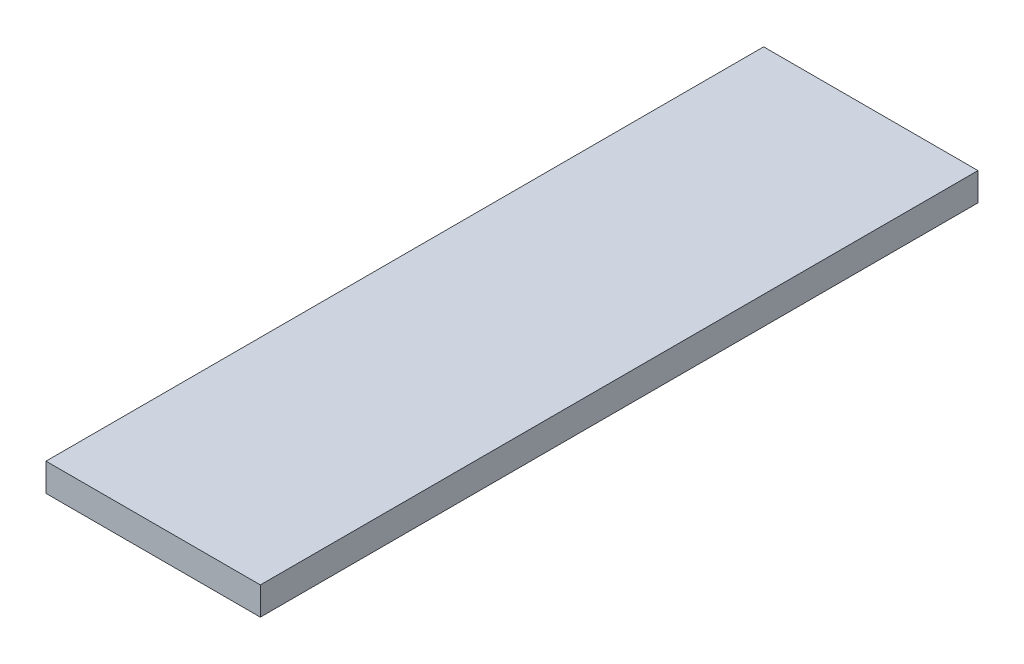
ISO-10303-21;
HEADER;
FILE_DESCRIPTION(('STEP AP214'),'2;1');
FILE_NAME('part.step','',(''),(''),'','','');
FILE_SCHEMA(('AUTOMOTIVE_DESIGN { 1 0 10303 214 1 1 1 1 }'));
ENDSEC;
DATA;
#1=APPLICATION_CONTEXT('core data for automotive mechanical design processes');
#2=APPLICATION_PROTOCOL_DEFINITION('international standard','automotive_design',2000,#1);
#3=PRODUCT_CONTEXT('',#1,'mechanical');
#4=PRODUCT('Part','Part','',(#3));
#5=PRODUCT_RELATED_PRODUCT_CATEGORY('part','',(#4));
#6=PRODUCT_DEFINITION_FORMATION('','',#4);
#7=PRODUCT_DEFINITION_CONTEXT('part definition',#1,'design');
#8=PRODUCT_DEFINITION('design','',#6,#7);
#9=PRODUCT_DEFINITION_SHAPE('','',#8);
#10=(LENGTH_UNIT() NAMED_UNIT(*) SI_UNIT(.MILLI.,.METRE.));
#11=(NAMED_UNIT(*) PLANE_ANGLE_UNIT() SI_UNIT($,.RADIAN.));
#12=(NAMED_UNIT(*) SI_UNIT($,.STERADIAN.) SOLID_ANGLE_UNIT());
#13=UNCERTAINTY_MEASURE_WITH_UNIT(LENGTH_MEASURE(1.E-05),#10,'distance_accuracy_value','');
#14=(GEOMETRIC_REPRESENTATION_CONTEXT(3) GLOBAL_UNCERTAINTY_ASSIGNED_CONTEXT((#13)) GLOBAL_UNIT_ASSIGNED_CONTEXT((#10,
#11,#12)) REPRESENTATION_CONTEXT('',''));
#15=CARTESIAN_POINT('',(0.,0.,0.));
#16=DIRECTION('',(0.,0.,1.));
#17=DIRECTION('',(1.,0.,0.));
#18=AXIS2_PLACEMENT_3D('',#15,#16,#17);
#19=CARTESIAN_POINT('',(-292.1,38.1,0.));
#20=DIRECTION('',(0.,0.,1.));
#21=DIRECTION('',(1.,0.,0.));
#22=AXIS2_PLACEMENT_3D('',#19,#20,#21);
#23=PLANE('',#22);
#24=DIRECTION('',(-1.,0.,0.));
#25=VECTOR('',#24,1.);
#26=CARTESIAN_POINT('',(-292.1,0.,0.));
#27=LINE('',#26,#25);
#28=CARTESIAN_POINT('',(0.,0.,0.));
#29=VERTEX_POINT('',#28);
#30=CARTESIAN_POINT('',(-292.1,0.,0.));
#31=VERTEX_POINT('',#30);
#32=EDGE_CURVE('E96',#29,#31,#27,.T.);
#33=ORIENTED_EDGE('',*,*,#32,.T.);
#34=DIRECTION('',(0.,-1.,0.));
#35=VECTOR('',#34,1.);
#36=CARTESIAN_POINT('',(-292.1,38.1,0.));
#37=LINE('',#36,#35);
#38=CARTESIAN_POINT('',(-292.1,38.1,0.));
#39=VERTEX_POINT('',#38);
#40=EDGE_CURVE('E11',#39,#31,#37,.T.);
#41=ORIENTED_EDGE('',*,*,#40,.F.);
#42=DIRECTION('',(-1.,0.,0.));
#43=VECTOR('',#42,1.);
#44=CARTESIAN_POINT('',(-292.1,38.1,0.));
#45=LINE('',#44,#43);
#46=CARTESIAN_POINT('',(0.,38.1,0.));
#47=VERTEX_POINT('',#46);
#48=EDGE_CURVE('E84',#47,#39,#45,.T.);
#49=ORIENTED_EDGE('',*,*,#48,.F.);
#50=DIRECTION('',(0.,-1.,0.));
#51=VECTOR('',#50,1.);
#52=CARTESIAN_POINT('',(0.,38.1,0.));
#53=LINE('',#52,#51);
#54=EDGE_CURVE('E92',#47,#29,#53,.T.);
#55=ORIENTED_EDGE('',*,*,#54,.T.);
#56=EDGE_LOOP('',(#33,#41,#49,#55));
#57=FACE_BOUND('',#56,.T.);
#58=ADVANCED_FACE('F33',(#57),#23,.F.);
#59=CARTESIAN_POINT('',(-292.1,38.1,977.9));
#60=DIRECTION('',(1.,0.,0.));
#61=DIRECTION('',(0.,0.,-1.));
#62=AXIS2_PLACEMENT_3D('',#59,#60,#61);
#63=PLANE('',#62);
#64=DIRECTION('',(0.,0.,1.));
#65=VECTOR('',#64,1.);
#66=CARTESIAN_POINT('',(-292.1,0.,977.9));
#67=LINE('',#66,#65);
#68=CARTESIAN_POINT('',(-292.1,0.,977.9));
#69=VERTEX_POINT('',#68);
#70=EDGE_CURVE('E88',#31,#69,#67,.T.);
#71=ORIENTED_EDGE('',*,*,#70,.T.);
#72=DIRECTION('',(0.,-1.,0.));
#73=VECTOR('',#72,1.);
#74=CARTESIAN_POINT('',(-292.1,38.1,977.9));
#75=LINE('',#74,#73);
#76=CARTESIAN_POINT('',(-292.1,38.1,977.9));
#77=VERTEX_POINT('',#76);
#78=EDGE_CURVE('E41',#77,#69,#75,.T.);
#79=ORIENTED_EDGE('',*,*,#78,.F.);
#80=DIRECTION('',(0.,0.,1.));
#81=VECTOR('',#80,1.);
#82=CARTESIAN_POINT('',(-292.1,38.1,977.9));
#83=LINE('',#82,#81);
#84=EDGE_CURVE('E79',#39,#77,#83,.T.);
#85=ORIENTED_EDGE('',*,*,#84,.F.);
#86=ORIENTED_EDGE('',*,*,#40,.T.);
#87=EDGE_LOOP('',(#71,#79,#85,#86));
#88=FACE_BOUND('',#87,.T.);
#89=ADVANCED_FACE('F87',(#88),#63,.F.);
#90=CARTESIAN_POINT('',(1.1975821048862E-13,38.1,977.9));
#91=DIRECTION('',(0.,0.,-1.));
#92=DIRECTION('',(-1.,0.,0.));
#93=AXIS2_PLACEMENT_3D('',#90,#91,#92);
#94=PLANE('',#93);
#95=DIRECTION('',(1.,0.,0.));
#96=VECTOR('',#95,1.);
#97=CARTESIAN_POINT('',(1.1975821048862E-13,0.,977.9));
#98=LINE('',#97,#96);
#99=CARTESIAN_POINT('',(1.1975821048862E-13,0.,977.9));
#100=VERTEX_POINT('',#99);
#101=EDGE_CURVE('E66',#69,#100,#98,.T.);
#102=ORIENTED_EDGE('',*,*,#101,.T.);
#103=DIRECTION('',(0.,-1.,0.));
#104=VECTOR('',#103,1.);
#105=CARTESIAN_POINT('',(1.1975821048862E-13,38.1,977.9));
#106=LINE('',#105,#104);
#107=CARTESIAN_POINT('',(1.1975821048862E-13,38.1,977.9));
#108=VERTEX_POINT('',#107);
#109=EDGE_CURVE('E89',#108,#100,#106,.T.);
#110=ORIENTED_EDGE('',*,*,#109,.F.);
#111=DIRECTION('',(1.,0.,0.));
#112=VECTOR('',#111,1.);
#113=CARTESIAN_POINT('',(1.1975821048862E-13,38.1,977.9));
#114=LINE('',#113,#112);
#115=EDGE_CURVE('E82',#77,#108,#114,.T.);
#116=ORIENTED_EDGE('',*,*,#115,.F.);
#117=ORIENTED_EDGE('',*,*,#78,.T.);
#118=EDGE_LOOP('',(#102,#110,#116,#117));
#119=FACE_BOUND('',#118,.T.);
#120=ADVANCED_FACE('F90',(#119),#94,.F.);
#121=CARTESIAN_POINT('',(0.,38.1,0.));
#122=DIRECTION('',(-1.,0.,0.));
#123=DIRECTION('',(0.,0.,1.));
#124=AXIS2_PLACEMENT_3D('',#121,#122,#123);
#125=PLANE('',#124);
#126=DIRECTION('',(0.,0.,-1.));
#127=VECTOR('',#126,1.);
#128=CARTESIAN_POINT('',(0.,0.,0.));
#129=LINE('',#128,#127);
#130=EDGE_CURVE('E72',#100,#29,#129,.T.);
#131=ORIENTED_EDGE('',*,*,#130,.T.);
#132=ORIENTED_EDGE('',*,*,#54,.F.);
#133=DIRECTION('',(0.,0.,-1.));
#134=VECTOR('',#133,1.);
#135=CARTESIAN_POINT('',(0.,38.1,0.));
#136=LINE('',#135,#134);
#137=EDGE_CURVE('E49',#108,#47,#136,.T.);
#138=ORIENTED_EDGE('',*,*,#137,.F.);
#139=ORIENTED_EDGE('',*,*,#109,.T.);
#140=EDGE_LOOP('',(#131,#132,#138,#139));
#141=FACE_BOUND('',#140,.T.);
#142=ADVANCED_FACE('F103',(#141),#125,.F.);
#143=CARTESIAN_POINT('',(0.,38.1,0.));
#144=DIRECTION('',(0.,-1.,0.));
#145=DIRECTION('',(0.,0.,-1.));
#146=AXIS2_PLACEMENT_3D('',#143,#144,#145);
#147=PLANE('',#146);
#148=ORIENTED_EDGE('',*,*,#48,.T.);
#149=ORIENTED_EDGE('',*,*,#84,.T.);
#150=ORIENTED_EDGE('',*,*,#115,.T.);
#151=ORIENTED_EDGE('',*,*,#137,.T.);
#152=EDGE_LOOP('',(#148,#149,#150,#151));
#153=FACE_BOUND('',#152,.T.);
#154=ADVANCED_FACE('F80',(#153),#147,.F.);
#155=CARTESIAN_POINT('',(0.,0.,0.));
#156=DIRECTION('',(0.,-1.,0.));
#157=DIRECTION('',(0.,0.,-1.));
#158=AXIS2_PLACEMENT_3D('',#155,#156,#157);
#159=PLANE('',#158);
#160=ORIENTED_EDGE('',*,*,#32,.F.);
#161=ORIENTED_EDGE('',*,*,#130,.F.);
#162=ORIENTED_EDGE('',*,*,#101,.F.);
#163=ORIENTED_EDGE('',*,*,#70,.F.);
#164=EDGE_LOOP('',(#160,#161,#162,#163));
#165=FACE_BOUND('',#164,.T.);
#166=ADVANCED_FACE('F106',(#165),#159,.T.);
#167=CLOSED_SHELL('',(#58,#89,#120,#142,#154,#166));
#168=MANIFOLD_SOLID_BREP('B2',#167);
#169=ADVANCED_BREP_SHAPE_REPRESENTATION('',(#18,#168),#14);
#170=SHAPE_DEFINITION_REPRESENTATION(#9,#169);
ENDSEC;
END-ISO-10303-21;
